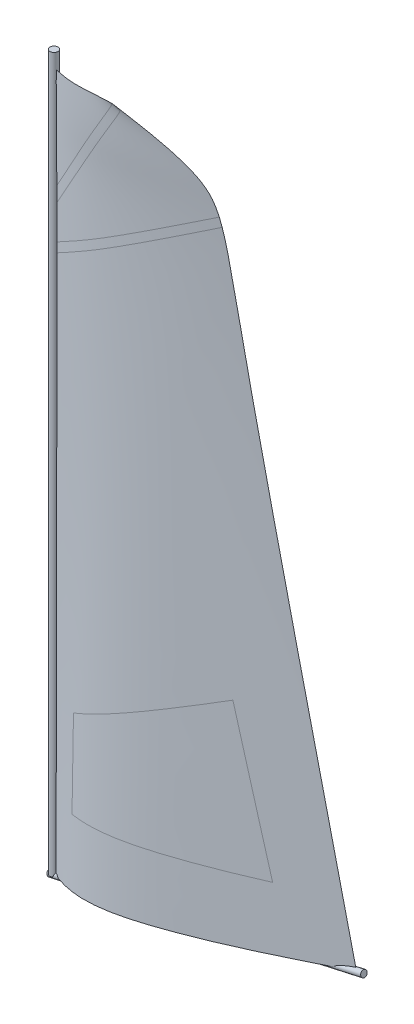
from build123d import *

# Parameters (mm, degrees)
ESQUISSE2_R      = 25
EXTRUSION1_DEPTH = 4500
ESQUISSE17_R     = 20
EXTRUSION3_DEPTH = 2025
ESQUISSE22_R     = 26.365837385
EXTRUSION4_DEPTH = 66.656989


with BuildPart() as part:
    # Esquisse2 → Extrusion1 (new body)
    with BuildSketch(Plane(origin=(0, 0, 0), x_dir=(1, 0, 0), z_dir=(0, 1, 0))):
        with Locations(Location((0, 0, 0), (0, 0, 270))):
            Circle(ESQUISSE2_R)
    extrude(amount=EXTRUSION1_DEPTH)

    # Esquisse17 → Extrusion3 (add)
    with BuildSketch(Plane(origin=(1957.389923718, 411.237256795, 0), x_dir=(0, 0, -1), z_dir=(-0.9762960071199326, -0.2164396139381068, 0))):
        with Locations(Location((0, -22.167427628, 0), (0, 0, 90))):
            Circle(ESQUISSE17_R)
    extrude(amount=EXTRUSION3_DEPTH)

    # Esquisse22 → Extrusion4 (add)
    with BuildSketch(Plane(origin=(781.036805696, 173.15169115, 0), x_dir=(0, 0, 1), z_dir=(-0.9762960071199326, -0.21643961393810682, 0))):
        with Locations((4.292040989, -17.466502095)):
            Circle(ESQUISSE22_R)
    extrude(amount=EXTRUSION4_DEPTH)


solid = part.part
